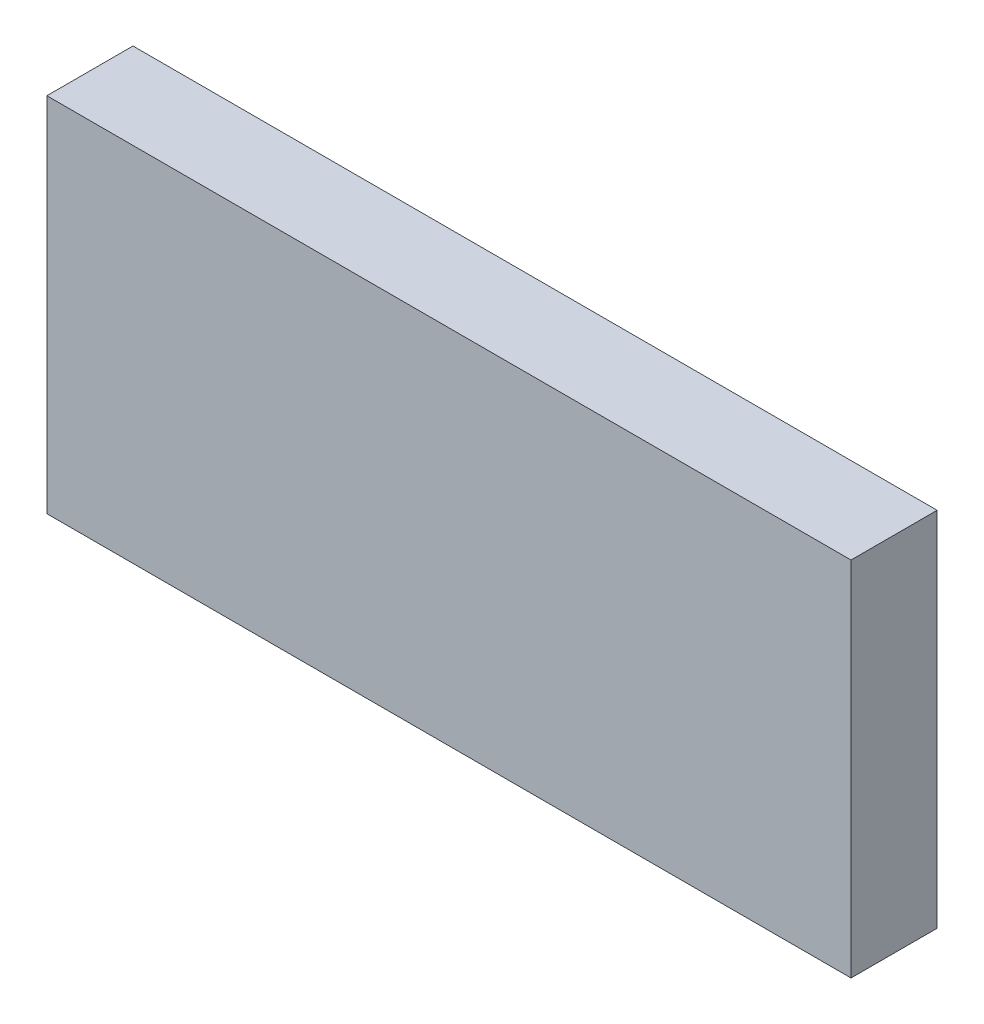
ISO-10303-21;
HEADER;
FILE_DESCRIPTION(('STEP AP214'),'2;1');
FILE_NAME('part.step','',(''),(''),'','','');
FILE_SCHEMA(('AUTOMOTIVE_DESIGN { 1 0 10303 214 1 1 1 1 }'));
ENDSEC;
DATA;
#1=APPLICATION_CONTEXT('core data for automotive mechanical design processes');
#2=APPLICATION_PROTOCOL_DEFINITION('international standard','automotive_design',2000,#1);
#3=PRODUCT_CONTEXT('',#1,'mechanical');
#4=PRODUCT('Part','Part','',(#3));
#5=PRODUCT_RELATED_PRODUCT_CATEGORY('part','',(#4));
#6=PRODUCT_DEFINITION_FORMATION('','',#4);
#7=PRODUCT_DEFINITION_CONTEXT('part definition',#1,'design');
#8=PRODUCT_DEFINITION('design','',#6,#7);
#9=PRODUCT_DEFINITION_SHAPE('','',#8);
#10=(LENGTH_UNIT() NAMED_UNIT(*) SI_UNIT(.MILLI.,.METRE.));
#11=(NAMED_UNIT(*) PLANE_ANGLE_UNIT() SI_UNIT($,.RADIAN.));
#12=(NAMED_UNIT(*) SI_UNIT($,.STERADIAN.) SOLID_ANGLE_UNIT());
#13=UNCERTAINTY_MEASURE_WITH_UNIT(LENGTH_MEASURE(1.E-05),#10,'distance_accuracy_value','');
#14=(GEOMETRIC_REPRESENTATION_CONTEXT(3) GLOBAL_UNCERTAINTY_ASSIGNED_CONTEXT((#13)) GLOBAL_UNIT_ASSIGNED_CONTEXT((#10,
#11,#12)) REPRESENTATION_CONTEXT('',''));
#15=CARTESIAN_POINT('',(0.,0.,0.));
#16=DIRECTION('',(0.,0.,1.));
#17=DIRECTION('',(1.,0.,0.));
#18=AXIS2_PLACEMENT_3D('',#15,#16,#17);
#19=CARTESIAN_POINT('',(52.1796849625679,23.4885569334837,11.176));
#20=DIRECTION('',(-1.,0.,0.));
#21=DIRECTION('',(0.,0.,1.));
#22=AXIS2_PLACEMENT_3D('',#19,#20,#21);
#23=PLANE('',#22);
#24=DIRECTION('',(0.,1.,0.));
#25=VECTOR('',#24,1.);
#26=CARTESIAN_POINT('',(52.1796849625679,23.4885569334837,0.));
#27=LINE('',#26,#25);
#28=CARTESIAN_POINT('',(52.1796849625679,-23.4885569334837,0.));
#29=VERTEX_POINT('',#28);
#30=CARTESIAN_POINT('',(52.1796849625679,23.4885569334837,0.));
#31=VERTEX_POINT('',#30);
#32=EDGE_CURVE('E95',#29,#31,#27,.T.);
#33=ORIENTED_EDGE('',*,*,#32,.T.);
#34=DIRECTION('',(0.,0.,-1.));
#35=VECTOR('',#34,1.);
#36=CARTESIAN_POINT('',(52.1796849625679,23.4885569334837,11.176));
#37=LINE('',#36,#35);
#38=CARTESIAN_POINT('',(52.1796849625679,23.4885569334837,11.176));
#39=VERTEX_POINT('',#38);
#40=EDGE_CURVE('E11',#39,#31,#37,.T.);
#41=ORIENTED_EDGE('',*,*,#40,.F.);
#42=DIRECTION('',(0.,1.,0.));
#43=VECTOR('',#42,1.);
#44=CARTESIAN_POINT('',(52.1796849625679,23.4885569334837,11.176));
#45=LINE('',#44,#43);
#46=CARTESIAN_POINT('',(52.1796849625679,-23.4885569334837,11.176));
#47=VERTEX_POINT('',#46);
#48=EDGE_CURVE('E83',#47,#39,#45,.T.);
#49=ORIENTED_EDGE('',*,*,#48,.F.);
#50=DIRECTION('',(0.,0.,-1.));
#51=VECTOR('',#50,1.);
#52=CARTESIAN_POINT('',(52.1796849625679,-23.4885569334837,11.176));
#53=LINE('',#52,#51);
#54=EDGE_CURVE('E91',#47,#29,#53,.T.);
#55=ORIENTED_EDGE('',*,*,#54,.T.);
#56=EDGE_LOOP('',(#33,#41,#49,#55));
#57=FACE_BOUND('',#56,.T.);
#58=ADVANCED_FACE('F32',(#57),#23,.F.);
#59=CARTESIAN_POINT('',(-52.1796849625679,23.4885569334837,11.176));
#60=DIRECTION('',(0.,-1.,0.));
#61=DIRECTION('',(0.,0.,-1.));
#62=AXIS2_PLACEMENT_3D('',#59,#60,#61);
#63=PLANE('',#62);
#64=DIRECTION('',(-1.,0.,0.));
#65=VECTOR('',#64,1.);
#66=CARTESIAN_POINT('',(-52.1796849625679,23.4885569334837,0.));
#67=LINE('',#66,#65);
#68=CARTESIAN_POINT('',(-52.1796849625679,23.4885569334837,0.));
#69=VERTEX_POINT('',#68);
#70=EDGE_CURVE('E87',#31,#69,#67,.T.);
#71=ORIENTED_EDGE('',*,*,#70,.T.);
#72=DIRECTION('',(0.,0.,-1.));
#73=VECTOR('',#72,1.);
#74=CARTESIAN_POINT('',(-52.1796849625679,23.4885569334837,11.176));
#75=LINE('',#74,#73);
#76=CARTESIAN_POINT('',(-52.1796849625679,23.4885569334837,11.176));
#77=VERTEX_POINT('',#76);
#78=EDGE_CURVE('E40',#77,#69,#75,.T.);
#79=ORIENTED_EDGE('',*,*,#78,.F.);
#80=DIRECTION('',(-1.,0.,0.));
#81=VECTOR('',#80,1.);
#82=CARTESIAN_POINT('',(-52.1796849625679,23.4885569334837,11.176));
#83=LINE('',#82,#81);
#84=EDGE_CURVE('E78',#39,#77,#83,.T.);
#85=ORIENTED_EDGE('',*,*,#84,.F.);
#86=ORIENTED_EDGE('',*,*,#40,.T.);
#87=EDGE_LOOP('',(#71,#79,#85,#86));
#88=FACE_BOUND('',#87,.T.);
#89=ADVANCED_FACE('F86',(#88),#63,.F.);
#90=CARTESIAN_POINT('',(-52.1796849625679,23.4885569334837,11.176));
#91=DIRECTION('',(1.,0.,0.));
#92=DIRECTION('',(0.,0.,-1.));
#93=AXIS2_PLACEMENT_3D('',#90,#91,#92);
#94=PLANE('',#93);
#95=DIRECTION('',(0.,-1.,0.));
#96=VECTOR('',#95,1.);
#97=CARTESIAN_POINT('',(-52.1796849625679,23.4885569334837,0.));
#98=LINE('',#97,#96);
#99=CARTESIAN_POINT('',(-52.1796849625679,-23.4885569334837,0.));
#100=VERTEX_POINT('',#99);
#101=EDGE_CURVE('E65',#69,#100,#98,.T.);
#102=ORIENTED_EDGE('',*,*,#101,.T.);
#103=DIRECTION('',(0.,0.,-1.));
#104=VECTOR('',#103,1.);
#105=CARTESIAN_POINT('',(-52.1796849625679,-23.4885569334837,11.176));
#106=LINE('',#105,#104);
#107=CARTESIAN_POINT('',(-52.1796849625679,-23.4885569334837,11.176));
#108=VERTEX_POINT('',#107);
#109=EDGE_CURVE('E88',#108,#100,#106,.T.);
#110=ORIENTED_EDGE('',*,*,#109,.F.);
#111=DIRECTION('',(0.,-1.,0.));
#112=VECTOR('',#111,1.);
#113=CARTESIAN_POINT('',(-52.1796849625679,23.4885569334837,11.176));
#114=LINE('',#113,#112);
#115=EDGE_CURVE('E81',#77,#108,#114,.T.);
#116=ORIENTED_EDGE('',*,*,#115,.F.);
#117=ORIENTED_EDGE('',*,*,#78,.T.);
#118=EDGE_LOOP('',(#102,#110,#116,#117));
#119=FACE_BOUND('',#118,.T.);
#120=ADVANCED_FACE('F89',(#119),#94,.F.);
#121=CARTESIAN_POINT('',(-52.1796849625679,-23.4885569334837,11.176));
#122=DIRECTION('',(0.,1.,0.));
#123=DIRECTION('',(0.,0.,1.));
#124=AXIS2_PLACEMENT_3D('',#121,#122,#123);
#125=PLANE('',#124);
#126=DIRECTION('',(1.,0.,0.));
#127=VECTOR('',#126,1.);
#128=CARTESIAN_POINT('',(-52.1796849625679,-23.4885569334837,0.));
#129=LINE('',#128,#127);
#130=EDGE_CURVE('E71',#100,#29,#129,.T.);
#131=ORIENTED_EDGE('',*,*,#130,.T.);
#132=ORIENTED_EDGE('',*,*,#54,.F.);
#133=DIRECTION('',(1.,0.,0.));
#134=VECTOR('',#133,1.);
#135=CARTESIAN_POINT('',(-52.1796849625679,-23.4885569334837,11.176));
#136=LINE('',#135,#134);
#137=EDGE_CURVE('E48',#108,#47,#136,.T.);
#138=ORIENTED_EDGE('',*,*,#137,.F.);
#139=ORIENTED_EDGE('',*,*,#109,.T.);
#140=EDGE_LOOP('',(#131,#132,#138,#139));
#141=FACE_BOUND('',#140,.T.);
#142=ADVANCED_FACE('F102',(#141),#125,.F.);
#143=CARTESIAN_POINT('',(52.1796849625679,-23.4885569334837,11.176));
#144=DIRECTION('',(0.,0.,1.));
#145=DIRECTION('',(1.,0.,0.));
#146=AXIS2_PLACEMENT_3D('',#143,#144,#145);
#147=PLANE('',#146);
#148=ORIENTED_EDGE('',*,*,#48,.T.);
#149=ORIENTED_EDGE('',*,*,#84,.T.);
#150=ORIENTED_EDGE('',*,*,#115,.T.);
#151=ORIENTED_EDGE('',*,*,#137,.T.);
#152=EDGE_LOOP('',(#148,#149,#150,#151));
#153=FACE_BOUND('',#152,.T.);
#154=ADVANCED_FACE('F79',(#153),#147,.T.);
#155=CARTESIAN_POINT('',(52.1796849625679,-23.4885569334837,0.));
#156=DIRECTION('',(0.,0.,1.));
#157=DIRECTION('',(1.,0.,0.));
#158=AXIS2_PLACEMENT_3D('',#155,#156,#157);
#159=PLANE('',#158);
#160=ORIENTED_EDGE('',*,*,#32,.F.);
#161=ORIENTED_EDGE('',*,*,#130,.F.);
#162=ORIENTED_EDGE('',*,*,#101,.F.);
#163=ORIENTED_EDGE('',*,*,#70,.F.);
#164=EDGE_LOOP('',(#160,#161,#162,#163));
#165=FACE_BOUND('',#164,.T.);
#166=ADVANCED_FACE('F105',(#165),#159,.F.);
#167=CLOSED_SHELL('',(#58,#89,#120,#142,#154,#166));
#168=MANIFOLD_SOLID_BREP('B2',#167);
#169=ADVANCED_BREP_SHAPE_REPRESENTATION('',(#18,#168),#14);
#170=SHAPE_DEFINITION_REPRESENTATION(#9,#169);
ENDSEC;
END-ISO-10303-21;
